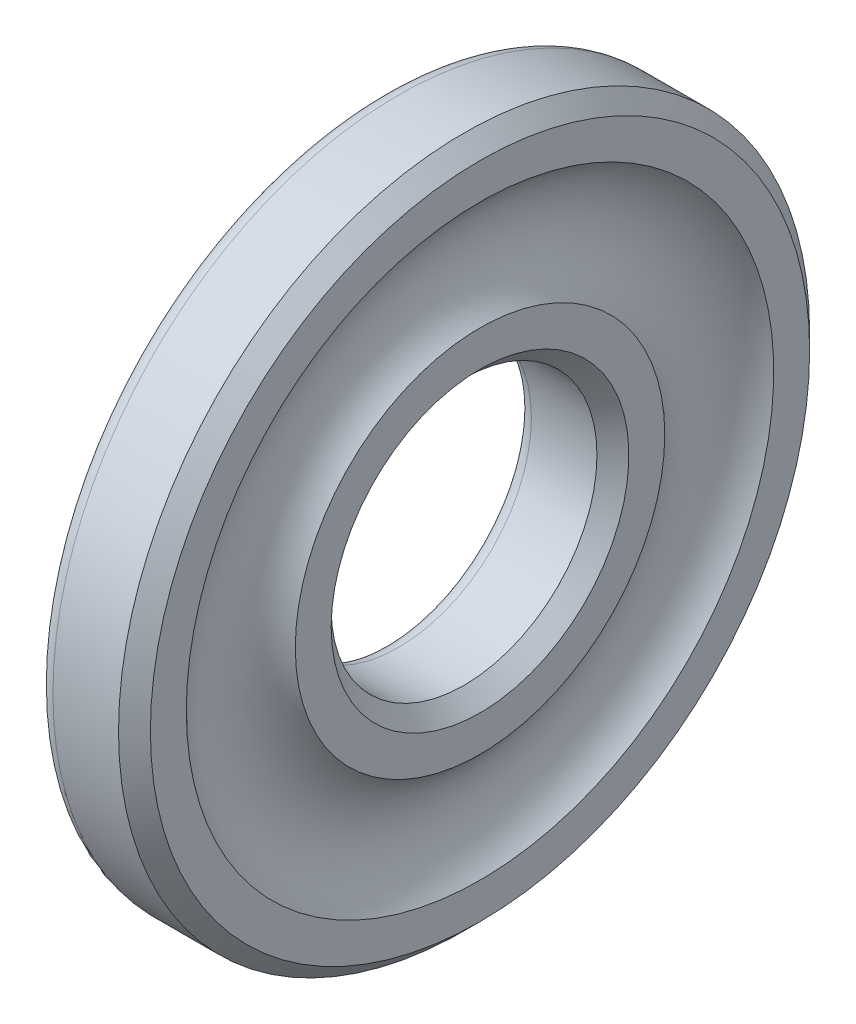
ISO-10303-21;
HEADER;
FILE_DESCRIPTION(('STEP AP214'),'2;1');
FILE_NAME('part.step','',(''),(''),'','','');
FILE_SCHEMA(('AUTOMOTIVE_DESIGN { 1 0 10303 214 1 1 1 1 }'));
ENDSEC;
DATA;
#1=APPLICATION_CONTEXT('core data for automotive mechanical design processes');
#2=APPLICATION_PROTOCOL_DEFINITION('international standard','automotive_design',2000,#1);
#3=PRODUCT_CONTEXT('',#1,'mechanical');
#4=PRODUCT('Part','Part','',(#3));
#5=PRODUCT_RELATED_PRODUCT_CATEGORY('part','',(#4));
#6=PRODUCT_DEFINITION_FORMATION('','',#4);
#7=PRODUCT_DEFINITION_CONTEXT('part definition',#1,'design');
#8=PRODUCT_DEFINITION('design','',#6,#7);
#9=PRODUCT_DEFINITION_SHAPE('','',#8);
#10=(LENGTH_UNIT() NAMED_UNIT(*) SI_UNIT(.MILLI.,.METRE.));
#11=(NAMED_UNIT(*) PLANE_ANGLE_UNIT() SI_UNIT($,.RADIAN.));
#12=(NAMED_UNIT(*) SI_UNIT($,.STERADIAN.) SOLID_ANGLE_UNIT());
#13=UNCERTAINTY_MEASURE_WITH_UNIT(LENGTH_MEASURE(1.E-05),#10,'distance_accuracy_value','');
#14=(GEOMETRIC_REPRESENTATION_CONTEXT(3) GLOBAL_UNCERTAINTY_ASSIGNED_CONTEXT((#13)) GLOBAL_UNIT_ASSIGNED_CONTEXT((#10,
#11,#12)) REPRESENTATION_CONTEXT('',''));
#15=CARTESIAN_POINT('',(0.,0.,0.));
#16=DIRECTION('',(0.,0.,1.));
#17=DIRECTION('',(1.,0.,0.));
#18=AXIS2_PLACEMENT_3D('',#15,#16,#17);
#19=CARTESIAN_POINT('',(0.6,0.,0.));
#20=DIRECTION('',(-1.,0.,0.));
#21=DIRECTION('',(0.,0.,1.));
#22=AXIS2_PLACEMENT_3D('',#19,#20,#21);
#23=TOROIDAL_SURFACE('',#22,5.6,0.6);
#24=CARTESIAN_POINT('',(0.6,0.,0.));
#25=DIRECTION('',(-1.,0.,0.));
#26=DIRECTION('',(0.,0.,1.));
#27=AXIS2_PLACEMENT_3D('',#24,#25,#26);
#28=CIRCLE('',#27,5.);
#29=CARTESIAN_POINT('',(0.6,0.,5.));
#30=VERTEX_POINT('',#29);
#31=EDGE_CURVE('E10',#30,#30,#28,.T.);
#32=ORIENTED_EDGE('',*,*,#31,.F.);
#33=EDGE_LOOP('',(#32));
#34=FACE_BOUND('',#33,.T.);
#35=CARTESIAN_POINT('',(0.,0.,0.));
#36=DIRECTION('',(-1.,0.,0.));
#37=DIRECTION('',(0.,0.,1.));
#38=AXIS2_PLACEMENT_3D('',#35,#36,#37);
#39=CIRCLE('',#38,5.6);
#40=CARTESIAN_POINT('',(0.,0.,5.6));
#41=VERTEX_POINT('',#40);
#42=EDGE_CURVE('E49',#41,#41,#39,.T.);
#43=ORIENTED_EDGE('',*,*,#42,.T.);
#44=EDGE_LOOP('',(#43));
#45=FACE_BOUND('',#44,.T.);
#46=ADVANCED_FACE('F14',(#34,#45),#23,.T.);
#47=CARTESIAN_POINT('',(0.,0.,0.));
#48=DIRECTION('',(-1.,0.,0.));
#49=DIRECTION('',(0.,0.,1.));
#50=AXIS2_PLACEMENT_3D('',#47,#48,#49);
#51=CYLINDRICAL_SURFACE('',#50,5.);
#52=CARTESIAN_POINT('',(3.06666666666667,0.,0.));
#53=DIRECTION('',(-1.,0.,0.));
#54=DIRECTION('',(0.,0.,1.));
#55=AXIS2_PLACEMENT_3D('',#52,#53,#54);
#56=CIRCLE('',#55,5.);
#57=CARTESIAN_POINT('',(3.06666666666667,0.,5.));
#58=VERTEX_POINT('',#57);
#59=EDGE_CURVE('E20',#58,#58,#56,.T.);
#60=ORIENTED_EDGE('',*,*,#59,.F.);
#61=EDGE_LOOP('',(#60));
#62=FACE_BOUND('',#61,.T.);
#63=ORIENTED_EDGE('',*,*,#31,.T.);
#64=EDGE_LOOP('',(#63));
#65=FACE_BOUND('',#64,.T.);
#66=ADVANCED_FACE('F97',(#62,#65),#51,.F.);
#67=CARTESIAN_POINT('',(3.06666666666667,0.,0.));
#68=DIRECTION('',(1.,0.,0.));
#69=DIRECTION('',(0.,0.,-1.));
#70=AXIS2_PLACEMENT_3D('',#67,#68,#69);
#71=CONICAL_SURFACE('',#70,5.,0.785398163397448);
#72=CARTESIAN_POINT('',(3.66666666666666,0.,0.));
#73=DIRECTION('',(-1.,0.,0.));
#74=DIRECTION('',(0.,0.,1.));
#75=AXIS2_PLACEMENT_3D('',#72,#73,#74);
#76=CIRCLE('',#75,5.6);
#77=CARTESIAN_POINT('',(3.66666666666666,0.,5.6));
#78=VERTEX_POINT('',#77);
#79=EDGE_CURVE('E24',#78,#78,#76,.T.);
#80=ORIENTED_EDGE('',*,*,#79,.F.);
#81=EDGE_LOOP('',(#80));
#82=FACE_BOUND('',#81,.T.);
#83=ORIENTED_EDGE('',*,*,#59,.T.);
#84=EDGE_LOOP('',(#83));
#85=FACE_BOUND('',#84,.T.);
#86=ADVANCED_FACE('F93',(#82,#85),#71,.F.);
#87=CARTESIAN_POINT('',(3.66666666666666,5.6,0.));
#88=DIRECTION('',(-1.,0.,0.));
#89=DIRECTION('',(0.,0.,1.));
#90=AXIS2_PLACEMENT_3D('',#87,#88,#89);
#91=PLANE('',#90);
#92=CARTESIAN_POINT('',(3.66666666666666,0.,0.));
#93=DIRECTION('',(-1.,0.,0.));
#94=DIRECTION('',(0.,0.,1.));
#95=AXIS2_PLACEMENT_3D('',#92,#93,#94);
#96=CIRCLE('',#95,6.95027102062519);
#97=CARTESIAN_POINT('',(3.66666666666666,0.,6.95027102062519));
#98=VERTEX_POINT('',#97);
#99=EDGE_CURVE('E28',#98,#98,#96,.T.);
#100=ORIENTED_EDGE('',*,*,#99,.F.);
#101=EDGE_LOOP('',(#100));
#102=FACE_BOUND('',#101,.T.);
#103=ORIENTED_EDGE('',*,*,#79,.T.);
#104=EDGE_LOOP('',(#103));
#105=FACE_BOUND('',#104,.T.);
#106=ADVANCED_FACE('F86',(#102,#105),#91,.F.);
#107=CARTESIAN_POINT('',(5.5,0.,0.));
#108=DIRECTION('',(-1.,0.,0.));
#109=DIRECTION('',(0.,0.,1.));
#110=AXIS2_PLACEMENT_3D('',#107,#108,#109);
#111=TOROIDAL_SURFACE('',#110,9.,2.75);
#112=ORIENTED_EDGE('',*,*,#99,.T.);
#113=EDGE_LOOP('',(#112));
#114=FACE_BOUND('',#113,.T.);
#115=CARTESIAN_POINT('',(3.66666666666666,0.,0.));
#116=DIRECTION('',(-1.,0.,0.));
#117=DIRECTION('',(0.,0.,1.));
#118=AXIS2_PLACEMENT_3D('',#115,#116,#117);
#119=CIRCLE('',#118,11.0497289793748);
#120=CARTESIAN_POINT('',(3.66666666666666,0.,11.0497289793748));
#121=VERTEX_POINT('',#120);
#122=EDGE_CURVE('E33',#121,#121,#119,.T.);
#123=ORIENTED_EDGE('',*,*,#122,.F.);
#124=EDGE_LOOP('',(#123));
#125=FACE_BOUND('',#124,.T.);
#126=ADVANCED_FACE('F81',(#114,#125),#111,.F.);
#127=CARTESIAN_POINT('',(3.66666666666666,11.0497289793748,0.));
#128=DIRECTION('',(-1.,0.,0.));
#129=DIRECTION('',(0.,0.,1.));
#130=AXIS2_PLACEMENT_3D('',#127,#128,#129);
#131=PLANE('',#130);
#132=CARTESIAN_POINT('',(3.66666666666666,0.,0.));
#133=DIRECTION('',(-1.,0.,0.));
#134=DIRECTION('',(0.,0.,1.));
#135=AXIS2_PLACEMENT_3D('',#132,#133,#134);
#136=CIRCLE('',#135,12.4);
#137=CARTESIAN_POINT('',(3.66666666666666,0.,12.4));
#138=VERTEX_POINT('',#137);
#139=EDGE_CURVE('E36',#138,#138,#136,.T.);
#140=ORIENTED_EDGE('',*,*,#139,.F.);
#141=EDGE_LOOP('',(#140));
#142=FACE_BOUND('',#141,.T.);
#143=ORIENTED_EDGE('',*,*,#122,.T.);
#144=EDGE_LOOP('',(#143));
#145=FACE_BOUND('',#144,.T.);
#146=ADVANCED_FACE('F75',(#142,#145),#131,.F.);
#147=CARTESIAN_POINT('',(3.66666666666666,0.,0.));
#148=DIRECTION('',(-1.,0.,0.));
#149=DIRECTION('',(0.,0.,1.));
#150=AXIS2_PLACEMENT_3D('',#147,#148,#149);
#151=CONICAL_SURFACE('',#150,12.4,0.785398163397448);
#152=CARTESIAN_POINT('',(3.06666666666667,0.,0.));
#153=DIRECTION('',(-1.,0.,0.));
#154=DIRECTION('',(0.,0.,1.));
#155=AXIS2_PLACEMENT_3D('',#152,#153,#154);
#156=CIRCLE('',#155,13.);
#157=CARTESIAN_POINT('',(3.06666666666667,0.,13.));
#158=VERTEX_POINT('',#157);
#159=EDGE_CURVE('E39',#158,#158,#156,.T.);
#160=ORIENTED_EDGE('',*,*,#159,.F.);
#161=EDGE_LOOP('',(#160));
#162=FACE_BOUND('',#161,.T.);
#163=ORIENTED_EDGE('',*,*,#139,.T.);
#164=EDGE_LOOP('',(#163));
#165=FACE_BOUND('',#164,.T.);
#166=ADVANCED_FACE('F69',(#162,#165),#151,.T.);
#167=CARTESIAN_POINT('',(0.,0.,0.));
#168=DIRECTION('',(-1.,0.,0.));
#169=DIRECTION('',(0.,0.,1.));
#170=AXIS2_PLACEMENT_3D('',#167,#168,#169);
#171=CYLINDRICAL_SURFACE('',#170,13.);
#172=CARTESIAN_POINT('',(0.6,0.,0.));
#173=DIRECTION('',(-1.,0.,0.));
#174=DIRECTION('',(0.,0.,1.));
#175=AXIS2_PLACEMENT_3D('',#172,#173,#174);
#176=CIRCLE('',#175,13.);
#177=CARTESIAN_POINT('',(0.6,0.,13.));
#178=VERTEX_POINT('',#177);
#179=EDGE_CURVE('E42',#178,#178,#176,.T.);
#180=ORIENTED_EDGE('',*,*,#179,.F.);
#181=EDGE_LOOP('',(#180));
#182=FACE_BOUND('',#181,.T.);
#183=ORIENTED_EDGE('',*,*,#159,.T.);
#184=EDGE_LOOP('',(#183));
#185=FACE_BOUND('',#184,.T.);
#186=ADVANCED_FACE('F63',(#182,#185),#171,.T.);
#187=CARTESIAN_POINT('',(0.6,0.,0.));
#188=DIRECTION('',(-1.,0.,0.));
#189=DIRECTION('',(0.,0.,1.));
#190=AXIS2_PLACEMENT_3D('',#187,#188,#189);
#191=TOROIDAL_SURFACE('',#190,12.4,0.6);
#192=CARTESIAN_POINT('',(0.,0.,0.));
#193=DIRECTION('',(-1.,0.,0.));
#194=DIRECTION('',(0.,0.,1.));
#195=AXIS2_PLACEMENT_3D('',#192,#193,#194);
#196=CIRCLE('',#195,12.4);
#197=CARTESIAN_POINT('',(0.,0.,12.4));
#198=VERTEX_POINT('',#197);
#199=EDGE_CURVE('E46',#198,#198,#196,.T.);
#200=ORIENTED_EDGE('',*,*,#199,.F.);
#201=EDGE_LOOP('',(#200));
#202=FACE_BOUND('',#201,.T.);
#203=ORIENTED_EDGE('',*,*,#179,.T.);
#204=EDGE_LOOP('',(#203));
#205=FACE_BOUND('',#204,.T.);
#206=ADVANCED_FACE('F57',(#202,#205),#191,.T.);
#207=CARTESIAN_POINT('',(0.,12.4,0.));
#208=DIRECTION('',(1.,0.,0.));
#209=DIRECTION('',(0.,0.,-1.));
#210=AXIS2_PLACEMENT_3D('',#207,#208,#209);
#211=PLANE('',#210);
#212=ORIENTED_EDGE('',*,*,#42,.F.);
#213=EDGE_LOOP('',(#212));
#214=FACE_BOUND('',#213,.T.);
#215=ORIENTED_EDGE('',*,*,#199,.T.);
#216=EDGE_LOOP('',(#215));
#217=FACE_BOUND('',#216,.T.);
#218=ADVANCED_FACE('F54',(#214,#217),#211,.F.);
#219=CLOSED_SHELL('',(#46,#66,#86,#106,#126,#146,#166,#186,#206,#218));
#220=MANIFOLD_SOLID_BREP('B1',#219);
#221=ADVANCED_BREP_SHAPE_REPRESENTATION('',(#18,#220),#14);
#222=SHAPE_DEFINITION_REPRESENTATION(#9,#221);
ENDSEC;
END-ISO-10303-21;
